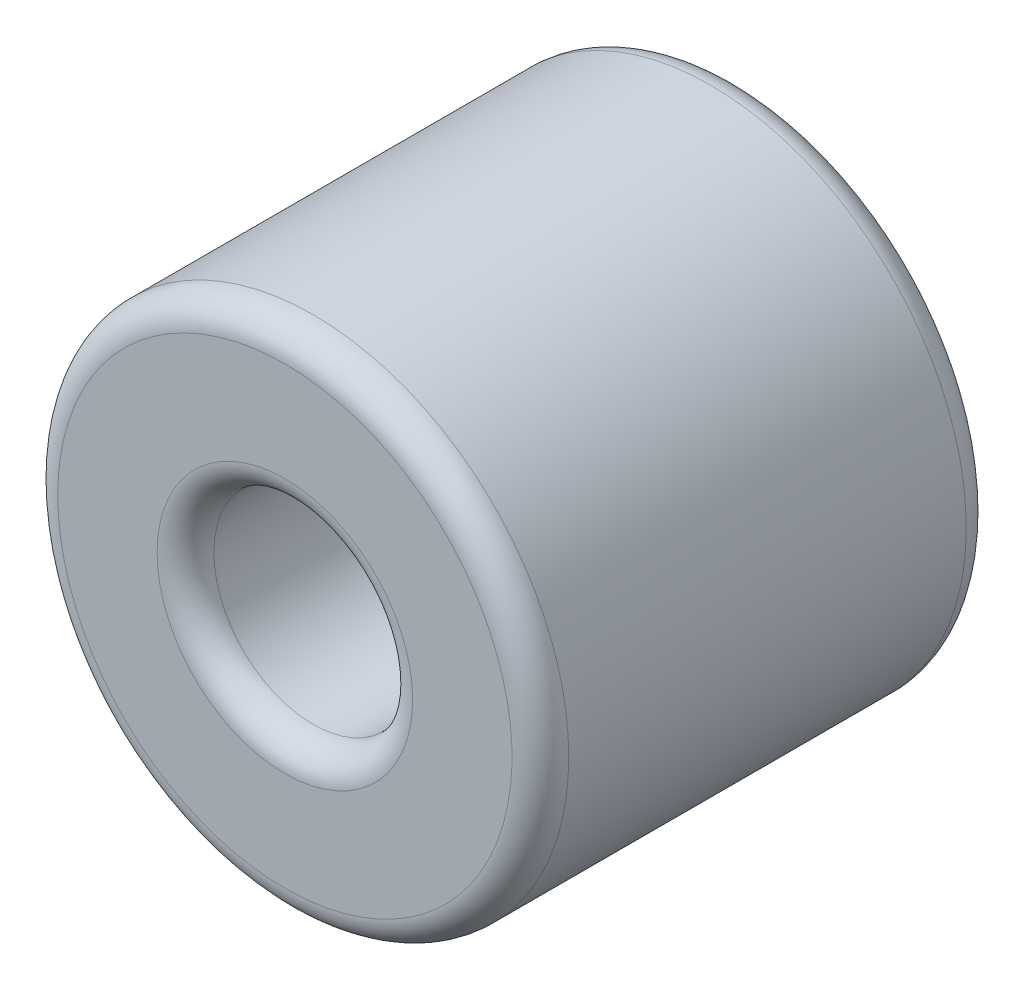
ISO-10303-21;
HEADER;
FILE_DESCRIPTION(('STEP AP214'),'2;1');
FILE_NAME('part.step','',(''),(''),'','','');
FILE_SCHEMA(('AUTOMOTIVE_DESIGN { 1 0 10303 214 1 1 1 1 }'));
ENDSEC;
DATA;
#1=APPLICATION_CONTEXT('core data for automotive mechanical design processes');
#2=APPLICATION_PROTOCOL_DEFINITION('international standard','automotive_design',2000,#1);
#3=PRODUCT_CONTEXT('',#1,'mechanical');
#4=PRODUCT('Part','Part','',(#3));
#5=PRODUCT_RELATED_PRODUCT_CATEGORY('part','',(#4));
#6=PRODUCT_DEFINITION_FORMATION('','',#4);
#7=PRODUCT_DEFINITION_CONTEXT('part definition',#1,'design');
#8=PRODUCT_DEFINITION('design','',#6,#7);
#9=PRODUCT_DEFINITION_SHAPE('','',#8);
#10=(LENGTH_UNIT() NAMED_UNIT(*) SI_UNIT(.MILLI.,.METRE.));
#11=(NAMED_UNIT(*) PLANE_ANGLE_UNIT() SI_UNIT($,.RADIAN.));
#12=(NAMED_UNIT(*) SI_UNIT($,.STERADIAN.) SOLID_ANGLE_UNIT());
#13=UNCERTAINTY_MEASURE_WITH_UNIT(LENGTH_MEASURE(1.E-05),#10,'distance_accuracy_value','');
#14=(GEOMETRIC_REPRESENTATION_CONTEXT(3) GLOBAL_UNCERTAINTY_ASSIGNED_CONTEXT((#13)) GLOBAL_UNIT_ASSIGNED_CONTEXT((#10,
#11,#12)) REPRESENTATION_CONTEXT('',''));
#15=CARTESIAN_POINT('',(0.,0.,0.));
#16=DIRECTION('',(0.,0.,1.));
#17=DIRECTION('',(1.,0.,0.));
#18=AXIS2_PLACEMENT_3D('',#15,#16,#17);
#19=CARTESIAN_POINT('',(0.,4.5,4.));
#20=DIRECTION('',(0.,0.,-1.));
#21=DIRECTION('',(-1.,0.,0.));
#22=AXIS2_PLACEMENT_3D('',#19,#20,#21);
#23=PLANE('',#22);
#24=CARTESIAN_POINT('',(0.,0.,4.));
#25=DIRECTION('',(0.,0.,-1.));
#26=DIRECTION('',(-1.,0.,0.));
#27=AXIS2_PLACEMENT_3D('',#24,#25,#26);
#28=CIRCLE('',#27,4.);
#29=CARTESIAN_POINT('',(-4.,0.,4.));
#30=VERTEX_POINT('',#29);
#31=EDGE_CURVE('E40',#30,#30,#28,.F.);
#32=ORIENTED_EDGE('',*,*,#31,.T.);
#33=EDGE_LOOP('',(#32));
#34=FACE_BOUND('',#33,.T.);
#35=CARTESIAN_POINT('',(0.,0.,4.));
#36=DIRECTION('',(0.,0.,-1.));
#37=DIRECTION('',(-1.,0.,0.));
#38=AXIS2_PLACEMENT_3D('',#35,#36,#37);
#39=CIRCLE('',#38,2.25);
#40=CARTESIAN_POINT('',(-2.25,0.,4.));
#41=VERTEX_POINT('',#40);
#42=EDGE_CURVE('E44',#41,#41,#39,.T.);
#43=ORIENTED_EDGE('',*,*,#42,.T.);
#44=EDGE_LOOP('',(#43));
#45=FACE_BOUND('',#44,.T.);
#46=ADVANCED_FACE('F29',(#34,#45),#23,.F.);
#47=CARTESIAN_POINT('',(0.,0.,4.));
#48=DIRECTION('',(0.,0.,1.));
#49=DIRECTION('',(1.,0.,0.));
#50=AXIS2_PLACEMENT_3D('',#47,#48,#49);
#51=CYLINDRICAL_SURFACE('',#50,1.75);
#52=CARTESIAN_POINT('',(0.,0.,3.5));
#53=DIRECTION('',(0.,0.,-1.));
#54=DIRECTION('',(-1.,0.,0.));
#55=AXIS2_PLACEMENT_3D('',#52,#53,#54);
#56=CIRCLE('',#55,1.75);
#57=CARTESIAN_POINT('',(-1.75,0.,3.5));
#58=VERTEX_POINT('',#57);
#59=EDGE_CURVE('E10',#58,#58,#56,.F.);
#60=ORIENTED_EDGE('',*,*,#59,.T.);
#61=EDGE_LOOP('',(#60));
#62=FACE_BOUND('',#61,.T.);
#63=CARTESIAN_POINT('',(0.,0.,-3.5));
#64=DIRECTION('',(0.,0.,1.));
#65=DIRECTION('',(1.,0.,0.));
#66=AXIS2_PLACEMENT_3D('',#63,#64,#65);
#67=CIRCLE('',#66,1.75);
#68=CARTESIAN_POINT('',(1.75,0.,-3.5));
#69=VERTEX_POINT('',#68);
#70=EDGE_CURVE('E36',#69,#69,#67,.F.);
#71=ORIENTED_EDGE('',*,*,#70,.T.);
#72=EDGE_LOOP('',(#71));
#73=FACE_BOUND('',#72,.T.);
#74=ADVANCED_FACE('F74',(#62,#73),#51,.F.);
#75=CARTESIAN_POINT('',(0.,1.75,-4.));
#76=DIRECTION('',(0.,0.,1.));
#77=DIRECTION('',(1.,0.,0.));
#78=AXIS2_PLACEMENT_3D('',#75,#76,#77);
#79=PLANE('',#78);
#80=CARTESIAN_POINT('',(0.,0.,-4.));
#81=DIRECTION('',(0.,0.,1.));
#82=DIRECTION('',(1.,0.,0.));
#83=AXIS2_PLACEMENT_3D('',#80,#81,#82);
#84=CIRCLE('',#83,4.);
#85=CARTESIAN_POINT('',(4.,0.,-4.));
#86=VERTEX_POINT('',#85);
#87=EDGE_CURVE('E49',#86,#86,#84,.F.);
#88=ORIENTED_EDGE('',*,*,#87,.T.);
#89=EDGE_LOOP('',(#88));
#90=FACE_BOUND('',#89,.T.);
#91=CARTESIAN_POINT('',(0.,0.,-4.));
#92=DIRECTION('',(0.,0.,1.));
#93=DIRECTION('',(1.,0.,0.));
#94=AXIS2_PLACEMENT_3D('',#91,#92,#93);
#95=CIRCLE('',#94,2.25);
#96=CARTESIAN_POINT('',(2.25,0.,-4.));
#97=VERTEX_POINT('',#96);
#98=EDGE_CURVE('E52',#97,#97,#95,.T.);
#99=ORIENTED_EDGE('',*,*,#98,.T.);
#100=EDGE_LOOP('',(#99));
#101=FACE_BOUND('',#100,.T.);
#102=ADVANCED_FACE('F90',(#90,#101),#79,.F.);
#103=CARTESIAN_POINT('',(0.,0.,4.));
#104=DIRECTION('',(0.,0.,1.));
#105=DIRECTION('',(1.,0.,0.));
#106=AXIS2_PLACEMENT_3D('',#103,#104,#105);
#107=CYLINDRICAL_SURFACE('',#106,4.5);
#108=CARTESIAN_POINT('',(0.,0.,-3.5));
#109=DIRECTION('',(0.,0.,1.));
#110=DIRECTION('',(1.,0.,0.));
#111=AXIS2_PLACEMENT_3D('',#108,#109,#110);
#112=CIRCLE('',#111,4.5);
#113=CARTESIAN_POINT('',(4.5,0.,-3.5));
#114=VERTEX_POINT('',#113);
#115=EDGE_CURVE('E55',#114,#114,#112,.T.);
#116=ORIENTED_EDGE('',*,*,#115,.T.);
#117=EDGE_LOOP('',(#116));
#118=FACE_BOUND('',#117,.T.);
#119=CARTESIAN_POINT('',(0.,0.,3.5));
#120=DIRECTION('',(0.,0.,-1.));
#121=DIRECTION('',(-1.,0.,0.));
#122=AXIS2_PLACEMENT_3D('',#119,#120,#121);
#123=CIRCLE('',#122,4.5);
#124=CARTESIAN_POINT('',(-4.5,0.,3.5));
#125=VERTEX_POINT('',#124);
#126=EDGE_CURVE('E58',#125,#125,#123,.T.);
#127=ORIENTED_EDGE('',*,*,#126,.T.);
#128=EDGE_LOOP('',(#127));
#129=FACE_BOUND('',#128,.T.);
#130=ADVANCED_FACE('F62',(#118,#129),#107,.T.);
#131=CARTESIAN_POINT('',(0.,0.,-3.5));
#132=DIRECTION('',(0.,0.,1.));
#133=DIRECTION('',(1.,0.,0.));
#134=AXIS2_PLACEMENT_3D('',#131,#132,#133);
#135=TOROIDAL_SURFACE('',#134,4.,0.5);
#136=ORIENTED_EDGE('',*,*,#87,.F.);
#137=EDGE_LOOP('',(#136));
#138=FACE_BOUND('',#137,.T.);
#139=ORIENTED_EDGE('',*,*,#115,.F.);
#140=EDGE_LOOP('',(#139));
#141=FACE_BOUND('',#140,.T.);
#142=ADVANCED_FACE('F68',(#138,#141),#135,.T.);
#143=CARTESIAN_POINT('',(0.,0.,3.5));
#144=DIRECTION('',(0.,0.,-1.));
#145=DIRECTION('',(-1.,0.,0.));
#146=AXIS2_PLACEMENT_3D('',#143,#144,#145);
#147=TOROIDAL_SURFACE('',#146,4.,0.5);
#148=ORIENTED_EDGE('',*,*,#126,.F.);
#149=EDGE_LOOP('',(#148));
#150=FACE_BOUND('',#149,.T.);
#151=ORIENTED_EDGE('',*,*,#31,.F.);
#152=EDGE_LOOP('',(#151));
#153=FACE_BOUND('',#152,.T.);
#154=ADVANCED_FACE('F64',(#150,#153),#147,.T.);
#155=CARTESIAN_POINT('',(0.,0.,3.5));
#156=DIRECTION('',(0.,0.,-1.));
#157=DIRECTION('',(-1.,0.,0.));
#158=AXIS2_PLACEMENT_3D('',#155,#156,#157);
#159=TOROIDAL_SURFACE('',#158,2.25,0.5);
#160=ORIENTED_EDGE('',*,*,#42,.F.);
#161=EDGE_LOOP('',(#160));
#162=FACE_BOUND('',#161,.T.);
#163=ORIENTED_EDGE('',*,*,#59,.F.);
#164=EDGE_LOOP('',(#163));
#165=FACE_BOUND('',#164,.T.);
#166=ADVANCED_FACE('F67',(#162,#165),#159,.T.);
#167=CARTESIAN_POINT('',(0.,0.,-3.5));
#168=DIRECTION('',(0.,0.,1.));
#169=DIRECTION('',(1.,0.,0.));
#170=AXIS2_PLACEMENT_3D('',#167,#168,#169);
#171=TOROIDAL_SURFACE('',#170,2.25,0.5);
#172=ORIENTED_EDGE('',*,*,#70,.F.);
#173=EDGE_LOOP('',(#172));
#174=FACE_BOUND('',#173,.T.);
#175=ORIENTED_EDGE('',*,*,#98,.F.);
#176=EDGE_LOOP('',(#175));
#177=FACE_BOUND('',#176,.T.);
#178=ADVANCED_FACE('F31',(#174,#177),#171,.T.);
#179=CLOSED_SHELL('',(#46,#74,#102,#130,#142,#154,#166,#178));
#180=MANIFOLD_SOLID_BREP('B2',#179);
#181=ADVANCED_BREP_SHAPE_REPRESENTATION('',(#18,#180),#14);
#182=SHAPE_DEFINITION_REPRESENTATION(#9,#181);
ENDSEC;
END-ISO-10303-21;
